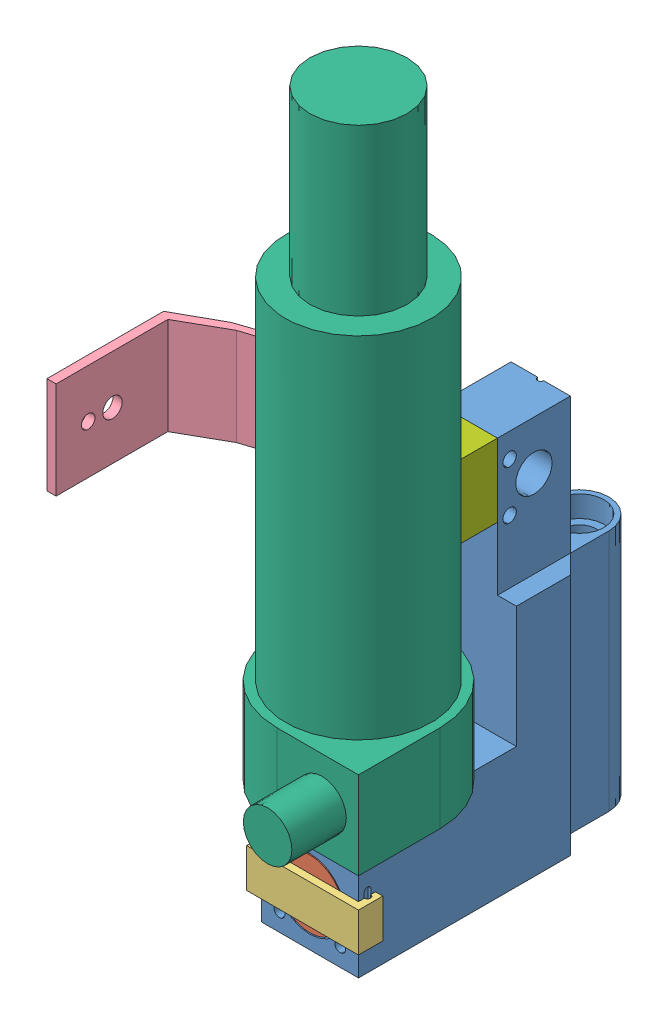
SolidWorks assembly GSC_6400 CT Pump Mate.SLDASM, configuration Default (file format 3400). Lengths in mm.
Overall size (88.14 189.23 100.97).
7 component instances, 7 part files, 16 mates.
Components (placement in the parent):
- GSC-6410 CT Pump Mate-1: GSC-6410 CT Pump Mate.SLDPRT [Default] at (-14.1966 -19.4197 20.6848) size (25.4 99.06 78.1)
- GSC-6420 CT Pump Mate Plug-1: GSC-6420 CT Pump Mate Plug.SLDPRT [Default] at (-14.1966 -6.7197 76.6918) x (-0.992678 -0.12079 0) z (0 0 -1) size (17.6 17.6 4.32)
- GSC-6430 CT Pump Mate Clip-1: GSC-6430 CT Pump Mate Clip.SLDPRT [Default] at (0.4084 -12.3077 77.8348) x (-1 0 0) z (0 0 -1) size (29.21 10.16 6.35)
- GSC-6401 SBE Pump Mount-1: GSC-6401 SBE Pump Mount.SLDPRT [Default] at (-80.9986 52.0178 82.9148) size (59.06 25.4 49.53)
- TBT-1: TBT.SLDPRT [Default] at (-14.1966 -6.7197 42.9098) size (17.27 17.27 18.8)
- sbe_5m-1: sbe_5m.SLDPRT [Default] at (-14.1966 35.1903 68.3098) x (0 0 1) z (0 1 0) size (56.9 42.67 171.7)
- GSC-6440 CT Pump Mate Saddle Block-1: GSC-6440 CT Pump Mate Saddle Block.SLDPRT [Default] at (-14.1966 60.5903 69.7987) x (1 0 0) z (0 1 0) size (15.49 10.92 19.05)
Mates (geometry in assembly coordinates):
- Concentric1: concentric anti-aligned: cylinder of GSC-6410 CT Pump Mate-1; cylinder of GSC-6420 CT Pump Mate Plug-1
- Distance1: distance = 1.905 mm aligned: plane of GSC-6410 CT Pump Mate-1 through (-1.4966 44.0803 20.6848) normal (1 0 0); plane of GSC-6430 CT Pump Mate Clip-1 through (0.4084 -2.1477 77.8348) normal (1 0 0)
- Coincident1: coincident aligned: plane of GSC-6410 CT Pump Mate-1 through (-26.8966 44.0803 81.0098) normal (0 0 1); plane of GSC-6420 CT Pump Mate Plug-1 through (-22.9332 -7.7828 81.0098) normal (0 0 1)
- Distance2: distance = 7.112 mm aligned: plane of GSC-6410 CT Pump Mate-1 through (-6.4496 -19.4197 20.6848) normal (0 -1 0); plane of GSC-6430 CT Pump Mate Clip-1 through (-26.8966 -12.3077 78.6285) normal (0 -1 0)
- Coincident3: coincident anti-aligned: plane of GSC-6410 CT Pump Mate-1 through (-26.8966 44.0803 81.0098) normal (0 0 1); plane of GSC-6430 CT Pump Mate Clip-1 through (-1.4966 -2.1477 81.0098) normal (0 0 -1)
- Coincident4: coincident anti-aligned: plane of GSC-6410 CT Pump Mate-1 through (-21.9436 79.6403 20.6848) normal (-1 0 0); plane of GSC-6401 SBE Pump Mount-1 through (-21.9436 77.4178 39.7348) normal (1 0 0)
- Coincident5: coincident anti-aligned: plane of GSC-6410 CT Pump Mate-1 through (-1.4966 12.3303 39.7348) normal (0 0 1); plane of GSC-6401 SBE Pump Mount-1 through (-50.5186 77.4178 39.7348) normal (0 0 -1)
- Concentric2: concentric aligned: cylinder of GSC-6410 CT Pump Mate-1; cylinder of GSC-6401 SBE Pump Mount-1
- Concentric3: concentric anti-aligned: cylinder of GSC-6410 CT Pump Mate-1; cylinder of TBT-1
- Coincident6: coincident anti-aligned: plane of GSC-6410 CT Pump Mate-1 through (-14.1966 -6.7197 42.9098) normal (0 0 1); plane of TBT-1 through (-14.1966 -6.7197 42.9098) normal (0 0 -1)
- Concentric4: concentric: cylinder of GSC-6410 CT Pump Mate-1; cylinder of ?
- Coincident7: coincident: plane of GSC-6410 CT Pump Mate-1 through (-1.4966 12.3303 81.0098) normal (0 1 0); plane of ? through (-14.1966 12.3303 68.3098) normal (0 -1 0)
- Coincident8: coincident aligned: plane of GSC-6410 CT Pump Mate-1 through (-14.1966 79.6403 20.6848) normal (0 1 0); plane of GSC-6440 CT Pump Mate Saddle Block-1 through (-14.1966 79.6403 69.7987) normal (0 1 0)
- Coincident9: coincident anti-aligned: plane of GSC-6410 CT Pump Mate-1 through (-1.4966 12.3303 39.7348) normal (0 0 1); plane of GSC-6440 CT Pump Mate Saddle Block-1 through (-6.4496 79.6403 39.7348) normal (0 0 -1)
- Coincident10: coincident aligned: plane of GSC-6410 CT Pump Mate-1 through (-21.9436 79.6403 20.6848) normal (-1 0 0); plane of GSC-6440 CT Pump Mate Saddle Block-1 through (-21.9436 79.6403 39.7348) normal (-1 0 0)
- Parallel1: parallel aligned: plane of ?; plane of ?
